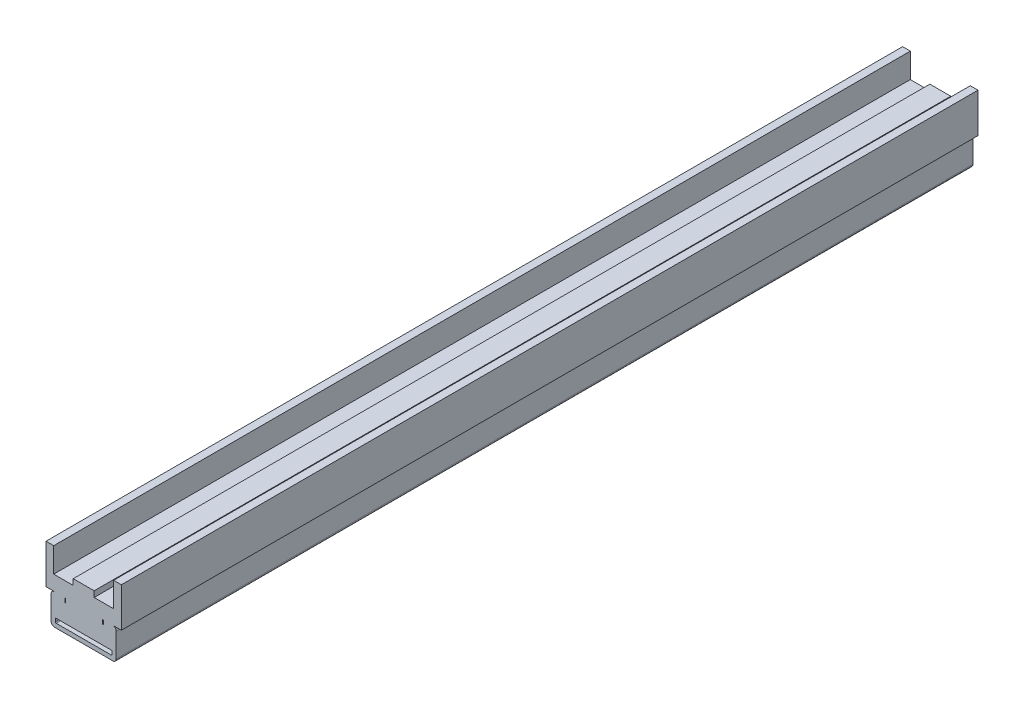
ISO-10303-21;
HEADER;
FILE_DESCRIPTION(('STEP AP214'),'2;1');
FILE_NAME('part.step','',(''),(''),'','','');
FILE_SCHEMA(('AUTOMOTIVE_DESIGN { 1 0 10303 214 1 1 1 1 }'));
ENDSEC;
DATA;
#1=APPLICATION_CONTEXT('core data for automotive mechanical design processes');
#2=APPLICATION_PROTOCOL_DEFINITION('international standard','automotive_design',2000,#1);
#3=PRODUCT_CONTEXT('',#1,'mechanical');
#4=PRODUCT('Part','Part','',(#3));
#5=PRODUCT_RELATED_PRODUCT_CATEGORY('part','',(#4));
#6=PRODUCT_DEFINITION_FORMATION('','',#4);
#7=PRODUCT_DEFINITION_CONTEXT('part definition',#1,'design');
#8=PRODUCT_DEFINITION('design','',#6,#7);
#9=PRODUCT_DEFINITION_SHAPE('','',#8);
#10=(LENGTH_UNIT() NAMED_UNIT(*) SI_UNIT(.MILLI.,.METRE.));
#11=(NAMED_UNIT(*) PLANE_ANGLE_UNIT() SI_UNIT($,.RADIAN.));
#12=(NAMED_UNIT(*) SI_UNIT($,.STERADIAN.) SOLID_ANGLE_UNIT());
#13=UNCERTAINTY_MEASURE_WITH_UNIT(LENGTH_MEASURE(1.E-05),#10,'distance_accuracy_value','');
#14=(GEOMETRIC_REPRESENTATION_CONTEXT(3) GLOBAL_UNCERTAINTY_ASSIGNED_CONTEXT((#13)) GLOBAL_UNIT_ASSIGNED_CONTEXT((#10,
#11,#12)) REPRESENTATION_CONTEXT('',''));
#15=CARTESIAN_POINT('',(0.,0.,0.));
#16=DIRECTION('',(0.,0.,1.));
#17=DIRECTION('',(1.,0.,0.));
#18=AXIS2_PLACEMENT_3D('',#15,#16,#17);
#19=CARTESIAN_POINT('',(17.,16.,500.));
#20=DIRECTION('',(0.,0.,1.));
#21=DIRECTION('',(1.,0.,0.));
#22=AXIS2_PLACEMENT_3D('',#19,#20,#21);
#23=PLANE('',#22);
#24=DIRECTION('',(1.,0.,0.));
#25=VECTOR('',#24,1.);
#26=CARTESIAN_POINT('',(-11.,15.5,500.));
#27=LINE('',#26,#25);
#28=CARTESIAN_POINT('',(-11.,15.5,500.));
#29=VERTEX_POINT('',#28);
#30=CARTESIAN_POINT('',(-10.5,15.5,500.));
#31=VERTEX_POINT('',#30);
#32=EDGE_CURVE('E273',#29,#31,#27,.T.);
#33=ORIENTED_EDGE('',*,*,#32,.F.);
#34=DIRECTION('',(0.,-1.,0.));
#35=VECTOR('',#34,1.);
#36=CARTESIAN_POINT('',(-11.,18.,500.));
#37=LINE('',#36,#35);
#38=CARTESIAN_POINT('',(-11.,18.,500.));
#39=VERTEX_POINT('',#38);
#40=EDGE_CURVE('E271',#39,#29,#37,.T.);
#41=ORIENTED_EDGE('',*,*,#40,.F.);
#42=DIRECTION('',(-1.,0.,0.));
#43=VECTOR('',#42,1.);
#44=CARTESIAN_POINT('',(-11.,18.,500.));
#45=LINE('',#44,#43);
#46=CARTESIAN_POINT('',(-10.5,18.,500.));
#47=VERTEX_POINT('',#46);
#48=EDGE_CURVE('E279',#47,#39,#45,.T.);
#49=ORIENTED_EDGE('',*,*,#48,.F.);
#50=DIRECTION('',(0.,1.,0.));
#51=VECTOR('',#50,1.);
#52=CARTESIAN_POINT('',(-10.5,18.,500.));
#53=LINE('',#52,#51);
#54=EDGE_CURVE('E276',#31,#47,#53,.T.);
#55=ORIENTED_EDGE('',*,*,#54,.F.);
#56=EDGE_LOOP('',(#33,#41,#49,#55));
#57=FACE_BOUND('',#56,.T.);
#58=DIRECTION('',(0.,-1.,0.));
#59=VECTOR('',#58,1.);
#60=CARTESIAN_POINT('',(-22.,18.,500.));
#61=LINE('',#60,#59);
#62=CARTESIAN_POINT('',(-22.,41.,500.));
#63=VERTEX_POINT('',#62);
#64=CARTESIAN_POINT('',(-22.,18.,500.));
#65=VERTEX_POINT('',#64);
#66=EDGE_CURVE('E347',#63,#65,#61,.T.);
#67=ORIENTED_EDGE('',*,*,#66,.T.);
#68=DIRECTION('',(1.,0.,0.));
#69=VECTOR('',#68,1.);
#70=CARTESIAN_POINT('',(-22.,18.,500.));
#71=LINE('',#70,#69);
#72=CARTESIAN_POINT('',(-17.,18.,500.));
#73=VERTEX_POINT('',#72);
#74=EDGE_CURVE('E350',#65,#73,#71,.T.);
#75=ORIENTED_EDGE('',*,*,#74,.T.);
#76=CARTESIAN_POINT('',(-17.,16.,500.));
#77=DIRECTION('',(0.,0.,1.));
#78=DIRECTION('',(1.,0.,0.));
#79=AXIS2_PLACEMENT_3D('',#76,#77,#78);
#80=CIRCLE('',#79,2.);
#81=CARTESIAN_POINT('',(-19.,16.,500.));
#82=VERTEX_POINT('',#81);
#83=EDGE_CURVE('E353',#73,#82,#80,.T.);
#84=ORIENTED_EDGE('',*,*,#83,.T.);
#85=DIRECTION('',(0.,-1.,0.));
#86=VECTOR('',#85,1.);
#87=CARTESIAN_POINT('',(-19.,2.,500.));
#88=LINE('',#87,#86);
#89=CARTESIAN_POINT('',(-19.,2.,500.));
#90=VERTEX_POINT('',#89);
#91=EDGE_CURVE('E355',#82,#90,#88,.T.);
#92=ORIENTED_EDGE('',*,*,#91,.T.);
#93=CARTESIAN_POINT('',(-17.,2.,500.));
#94=DIRECTION('',(0.,0.,1.));
#95=DIRECTION('',(1.,0.,0.));
#96=AXIS2_PLACEMENT_3D('',#93,#94,#95);
#97=CIRCLE('',#96,2.);
#98=CARTESIAN_POINT('',(-17.,0.,500.));
#99=VERTEX_POINT('',#98);
#100=EDGE_CURVE('E357',#90,#99,#97,.T.);
#101=ORIENTED_EDGE('',*,*,#100,.T.);
#102=DIRECTION('',(1.,0.,0.));
#103=VECTOR('',#102,1.);
#104=CARTESIAN_POINT('',(-17.,0.,500.));
#105=LINE('',#104,#103);
#106=CARTESIAN_POINT('',(17.,0.,500.));
#107=VERTEX_POINT('',#106);
#108=EDGE_CURVE('E359',#99,#107,#105,.T.);
#109=ORIENTED_EDGE('',*,*,#108,.T.);
#110=CARTESIAN_POINT('',(17.,2.,500.));
#111=DIRECTION('',(0.,0.,1.));
#112=DIRECTION('',(-1.,0.,0.));
#113=AXIS2_PLACEMENT_3D('',#110,#111,#112);
#114=CIRCLE('',#113,2.);
#115=CARTESIAN_POINT('',(19.,2.,500.));
#116=VERTEX_POINT('',#115);
#117=EDGE_CURVE('E361',#107,#116,#114,.T.);
#118=ORIENTED_EDGE('',*,*,#117,.T.);
#119=DIRECTION('',(0.,1.,0.));
#120=VECTOR('',#119,1.);
#121=CARTESIAN_POINT('',(19.,2.,500.));
#122=LINE('',#121,#120);
#123=CARTESIAN_POINT('',(19.,16.,500.));
#124=VERTEX_POINT('',#123);
#125=EDGE_CURVE('E363',#116,#124,#122,.T.);
#126=ORIENTED_EDGE('',*,*,#125,.T.);
#127=CARTESIAN_POINT('',(17.,16.,500.));
#128=DIRECTION('',(0.,0.,1.));
#129=DIRECTION('',(1.,0.,0.));
#130=AXIS2_PLACEMENT_3D('',#127,#128,#129);
#131=CIRCLE('',#130,2.);
#132=CARTESIAN_POINT('',(17.,18.,500.));
#133=VERTEX_POINT('',#132);
#134=EDGE_CURVE('E365',#124,#133,#131,.T.);
#135=ORIENTED_EDGE('',*,*,#134,.T.);
#136=DIRECTION('',(1.,0.,0.));
#137=VECTOR('',#136,1.);
#138=CARTESIAN_POINT('',(17.,18.,500.));
#139=LINE('',#138,#137);
#140=CARTESIAN_POINT('',(22.,18.,500.));
#141=VERTEX_POINT('',#140);
#142=EDGE_CURVE('E367',#133,#141,#139,.T.);
#143=ORIENTED_EDGE('',*,*,#142,.T.);
#144=DIRECTION('',(0.,1.,0.));
#145=VECTOR('',#144,1.);
#146=CARTESIAN_POINT('',(22.,18.,500.));
#147=LINE('',#146,#145);
#148=CARTESIAN_POINT('',(22.,41.,500.));
#149=VERTEX_POINT('',#148);
#150=EDGE_CURVE('E369',#141,#149,#147,.T.);
#151=ORIENTED_EDGE('',*,*,#150,.T.);
#152=DIRECTION('',(-1.,0.,0.));
#153=VECTOR('',#152,1.);
#154=CARTESIAN_POINT('',(17.5,41.,500.));
#155=LINE('',#154,#153);
#156=CARTESIAN_POINT('',(17.5,41.,500.));
#157=VERTEX_POINT('',#156);
#158=EDGE_CURVE('E371',#149,#157,#155,.T.);
#159=ORIENTED_EDGE('',*,*,#158,.T.);
#160=DIRECTION('',(0.,-1.,0.));
#161=VECTOR('',#160,1.);
#162=CARTESIAN_POINT('',(17.5,26.6,500.));
#163=LINE('',#162,#161);
#164=CARTESIAN_POINT('',(17.5,26.6,500.));
#165=VERTEX_POINT('',#164);
#166=EDGE_CURVE('E373',#157,#165,#163,.T.);
#167=ORIENTED_EDGE('',*,*,#166,.T.);
#168=DIRECTION('',(-1.,0.,0.));
#169=VECTOR('',#168,1.);
#170=CARTESIAN_POINT('',(6.1,26.6,500.));
#171=LINE('',#170,#169);
#172=CARTESIAN_POINT('',(6.1,26.6,500.));
#173=VERTEX_POINT('',#172);
#174=EDGE_CURVE('E375',#165,#173,#171,.T.);
#175=ORIENTED_EDGE('',*,*,#174,.T.);
#176=DIRECTION('',(0.,1.,0.));
#177=VECTOR('',#176,1.);
#178=CARTESIAN_POINT('',(6.1,30.,500.));
#179=LINE('',#178,#177);
#180=CARTESIAN_POINT('',(6.1,30.,500.));
#181=VERTEX_POINT('',#180);
#182=EDGE_CURVE('E377',#173,#181,#179,.T.);
#183=ORIENTED_EDGE('',*,*,#182,.T.);
#184=DIRECTION('',(-1.,0.,0.));
#185=VECTOR('',#184,1.);
#186=CARTESIAN_POINT('',(-6.1,30.,500.));
#187=LINE('',#186,#185);
#188=CARTESIAN_POINT('',(-6.1,30.,500.));
#189=VERTEX_POINT('',#188);
#190=EDGE_CURVE('E379',#181,#189,#187,.T.);
#191=ORIENTED_EDGE('',*,*,#190,.T.);
#192=DIRECTION('',(0.,-1.,0.));
#193=VECTOR('',#192,1.);
#194=CARTESIAN_POINT('',(-6.1,26.6,500.));
#195=LINE('',#194,#193);
#196=CARTESIAN_POINT('',(-6.1,26.6,500.));
#197=VERTEX_POINT('',#196);
#198=EDGE_CURVE('E381',#189,#197,#195,.T.);
#199=ORIENTED_EDGE('',*,*,#198,.T.);
#200=DIRECTION('',(-1.,0.,0.));
#201=VECTOR('',#200,1.);
#202=CARTESIAN_POINT('',(-17.5,26.6,500.));
#203=LINE('',#202,#201);
#204=CARTESIAN_POINT('',(-17.5,26.6,500.));
#205=VERTEX_POINT('',#204);
#206=EDGE_CURVE('E383',#197,#205,#203,.T.);
#207=ORIENTED_EDGE('',*,*,#206,.T.);
#208=DIRECTION('',(0.,1.,0.));
#209=VECTOR('',#208,1.);
#210=CARTESIAN_POINT('',(-17.5,41.,500.));
#211=LINE('',#210,#209);
#212=CARTESIAN_POINT('',(-17.5,41.,500.));
#213=VERTEX_POINT('',#212);
#214=EDGE_CURVE('E385',#205,#213,#211,.T.);
#215=ORIENTED_EDGE('',*,*,#214,.T.);
#216=DIRECTION('',(-1.,0.,0.));
#217=VECTOR('',#216,1.);
#218=CARTESIAN_POINT('',(-22.,41.,500.));
#219=LINE('',#218,#217);
#220=EDGE_CURVE('E387',#213,#63,#219,.T.);
#221=ORIENTED_EDGE('',*,*,#220,.T.);
#222=EDGE_LOOP('',(#67,#75,#84,#92,#101,#109,#118,#126,#135,#143,#151,#159,#167,#175,#183,#191,
#199,#207,#215,#221));
#223=FACE_BOUND('',#222,.T.);
#224=CARTESIAN_POINT('',(-16.,3.,500.));
#225=DIRECTION('',(0.,0.,1.));
#226=DIRECTION('',(-1.,0.,0.));
#227=AXIS2_PLACEMENT_3D('',#224,#225,#226);
#228=CIRCLE('',#227,0.5);
#229=CARTESIAN_POINT('',(-16.5,3.,500.));
#230=VERTEX_POINT('',#229);
#231=CARTESIAN_POINT('',(-16.,2.5,500.));
#232=VERTEX_POINT('',#231);
#233=EDGE_CURVE('E304',#230,#232,#228,.T.);
#234=ORIENTED_EDGE('',*,*,#233,.F.);
#235=DIRECTION('',(0.,-1.,0.));
#236=VECTOR('',#235,1.);
#237=CARTESIAN_POINT('',(-16.5,5.,500.));
#238=LINE('',#237,#236);
#239=CARTESIAN_POINT('',(-16.5,5.,500.));
#240=VERTEX_POINT('',#239);
#241=EDGE_CURVE('E302',#240,#230,#238,.T.);
#242=ORIENTED_EDGE('',*,*,#241,.F.);
#243=DIRECTION('',(-1.,0.,0.));
#244=VECTOR('',#243,1.);
#245=CARTESIAN_POINT('',(-16.5,5.,500.));
#246=LINE('',#245,#244);
#247=CARTESIAN_POINT('',(16.5,5.,500.));
#248=VERTEX_POINT('',#247);
#249=EDGE_CURVE('E314',#248,#240,#246,.T.);
#250=ORIENTED_EDGE('',*,*,#249,.F.);
#251=DIRECTION('',(0.,1.,0.));
#252=VECTOR('',#251,1.);
#253=CARTESIAN_POINT('',(16.5,5.,500.));
#254=LINE('',#253,#252);
#255=CARTESIAN_POINT('',(16.5,3.,500.));
#256=VERTEX_POINT('',#255);
#257=EDGE_CURVE('E311',#256,#248,#254,.T.);
#258=ORIENTED_EDGE('',*,*,#257,.F.);
#259=CARTESIAN_POINT('',(16.,3.,500.));
#260=DIRECTION('',(0.,0.,1.));
#261=DIRECTION('',(-1.,0.,0.));
#262=AXIS2_PLACEMENT_3D('',#259,#260,#261);
#263=CIRCLE('',#262,0.5);
#264=CARTESIAN_POINT('',(16.,2.5,500.));
#265=VERTEX_POINT('',#264);
#266=EDGE_CURVE('E309',#265,#256,#263,.T.);
#267=ORIENTED_EDGE('',*,*,#266,.F.);
#268=DIRECTION('',(1.,0.,0.));
#269=VECTOR('',#268,1.);
#270=CARTESIAN_POINT('',(-16.,2.5,500.));
#271=LINE('',#270,#269);
#272=EDGE_CURVE('E307',#232,#265,#271,.T.);
#273=ORIENTED_EDGE('',*,*,#272,.F.);
#274=EDGE_LOOP('',(#234,#242,#250,#258,#267,#273));
#275=FACE_BOUND('',#274,.T.);
#276=DIRECTION('',(1.,0.,0.));
#277=VECTOR('',#276,1.);
#278=CARTESIAN_POINT('',(11.,15.5,500.));
#279=LINE('',#278,#277);
#280=CARTESIAN_POINT('',(11.,15.5,500.));
#281=VERTEX_POINT('',#280);
#282=CARTESIAN_POINT('',(11.5,15.5,500.));
#283=VERTEX_POINT('',#282);
#284=EDGE_CURVE('E243',#281,#283,#279,.T.);
#285=ORIENTED_EDGE('',*,*,#284,.F.);
#286=DIRECTION('',(0.,-1.,0.));
#287=VECTOR('',#286,1.);
#288=CARTESIAN_POINT('',(11.,18.,500.));
#289=LINE('',#288,#287);
#290=CARTESIAN_POINT('',(11.,18.,500.));
#291=VERTEX_POINT('',#290);
#292=EDGE_CURVE('E235',#291,#281,#289,.T.);
#293=ORIENTED_EDGE('',*,*,#292,.F.);
#294=DIRECTION('',(-1.,0.,0.));
#295=VECTOR('',#294,1.);
#296=CARTESIAN_POINT('',(11.,18.,500.));
#297=LINE('',#296,#295);
#298=CARTESIAN_POINT('',(11.5,18.,500.));
#299=VERTEX_POINT('',#298);
#300=EDGE_CURVE('E257',#299,#291,#297,.T.);
#301=ORIENTED_EDGE('',*,*,#300,.F.);
#302=DIRECTION('',(0.,1.,0.));
#303=VECTOR('',#302,1.);
#304=CARTESIAN_POINT('',(11.5,18.,500.));
#305=LINE('',#304,#303);
#306=EDGE_CURVE('E255',#283,#299,#305,.T.);
#307=ORIENTED_EDGE('',*,*,#306,.F.);
#308=EDGE_LOOP('',(#285,#293,#301,#307));
#309=FACE_BOUND('',#308,.T.);
#310=ADVANCED_FACE('F14',(#57,#223,#275,#309),#23,.T.);
#311=CARTESIAN_POINT('',(17.,16.,0.));
#312=DIRECTION('',(0.,0.,1.));
#313=DIRECTION('',(1.,0.,0.));
#314=AXIS2_PLACEMENT_3D('',#311,#312,#313);
#315=PLANE('',#314);
#316=DIRECTION('',(0.,-1.,0.));
#317=VECTOR('',#316,1.);
#318=CARTESIAN_POINT('',(-11.,18.,0.));
#319=LINE('',#318,#317);
#320=CARTESIAN_POINT('',(-11.,18.,0.));
#321=VERTEX_POINT('',#320);
#322=CARTESIAN_POINT('',(-11.,15.5,0.));
#323=VERTEX_POINT('',#322);
#324=EDGE_CURVE('E251',#321,#323,#319,.T.);
#325=ORIENTED_EDGE('',*,*,#324,.T.);
#326=DIRECTION('',(1.,0.,0.));
#327=VECTOR('',#326,1.);
#328=CARTESIAN_POINT('',(-11.,15.5,0.));
#329=LINE('',#328,#327);
#330=CARTESIAN_POINT('',(-10.5,15.5,0.));
#331=VERTEX_POINT('',#330);
#332=EDGE_CURVE('E284',#323,#331,#329,.T.);
#333=ORIENTED_EDGE('',*,*,#332,.T.);
#334=DIRECTION('',(0.,1.,0.));
#335=VECTOR('',#334,1.);
#336=CARTESIAN_POINT('',(-10.5,18.,0.));
#337=LINE('',#336,#335);
#338=CARTESIAN_POINT('',(-10.5,18.,0.));
#339=VERTEX_POINT('',#338);
#340=EDGE_CURVE('E287',#331,#339,#337,.T.);
#341=ORIENTED_EDGE('',*,*,#340,.T.);
#342=DIRECTION('',(-1.,0.,0.));
#343=VECTOR('',#342,1.);
#344=CARTESIAN_POINT('',(-11.,18.,0.));
#345=LINE('',#344,#343);
#346=EDGE_CURVE('E274',#339,#321,#345,.T.);
#347=ORIENTED_EDGE('',*,*,#346,.T.);
#348=EDGE_LOOP('',(#325,#333,#341,#347));
#349=FACE_BOUND('',#348,.T.);
#350=DIRECTION('',(0.,-1.,0.));
#351=VECTOR('',#350,1.);
#352=CARTESIAN_POINT('',(-22.,18.,0.));
#353=LINE('',#352,#351);
#354=CARTESIAN_POINT('',(-22.,41.,0.));
#355=VERTEX_POINT('',#354);
#356=CARTESIAN_POINT('',(-22.,18.,0.));
#357=VERTEX_POINT('',#356);
#358=EDGE_CURVE('E346',#355,#357,#353,.T.);
#359=ORIENTED_EDGE('',*,*,#358,.F.);
#360=DIRECTION('',(-1.,0.,0.));
#361=VECTOR('',#360,1.);
#362=CARTESIAN_POINT('',(-22.,41.,0.));
#363=LINE('',#362,#361);
#364=CARTESIAN_POINT('',(-17.5,41.,0.));
#365=VERTEX_POINT('',#364);
#366=EDGE_CURVE('E351',#365,#355,#363,.T.);
#367=ORIENTED_EDGE('',*,*,#366,.F.);
#368=DIRECTION('',(0.,1.,0.));
#369=VECTOR('',#368,1.);
#370=CARTESIAN_POINT('',(-17.5,41.,0.));
#371=LINE('',#370,#369);
#372=CARTESIAN_POINT('',(-17.5,26.6,0.));
#373=VERTEX_POINT('',#372);
#374=EDGE_CURVE('E426',#373,#365,#371,.T.);
#375=ORIENTED_EDGE('',*,*,#374,.F.);
#376=DIRECTION('',(-1.,0.,0.));
#377=VECTOR('',#376,1.);
#378=CARTESIAN_POINT('',(-17.5,26.6,0.));
#379=LINE('',#378,#377);
#380=CARTESIAN_POINT('',(-6.1,26.6,0.));
#381=VERTEX_POINT('',#380);
#382=EDGE_CURVE('E424',#381,#373,#379,.T.);
#383=ORIENTED_EDGE('',*,*,#382,.F.);
#384=DIRECTION('',(0.,-1.,0.));
#385=VECTOR('',#384,1.);
#386=CARTESIAN_POINT('',(-6.1,26.6,0.));
#387=LINE('',#386,#385);
#388=CARTESIAN_POINT('',(-6.1,30.,0.));
#389=VERTEX_POINT('',#388);
#390=EDGE_CURVE('E422',#389,#381,#387,.T.);
#391=ORIENTED_EDGE('',*,*,#390,.F.);
#392=DIRECTION('',(-1.,0.,0.));
#393=VECTOR('',#392,1.);
#394=CARTESIAN_POINT('',(-6.1,30.,0.));
#395=LINE('',#394,#393);
#396=CARTESIAN_POINT('',(6.1,30.,0.));
#397=VERTEX_POINT('',#396);
#398=EDGE_CURVE('E420',#397,#389,#395,.T.);
#399=ORIENTED_EDGE('',*,*,#398,.F.);
#400=DIRECTION('',(0.,1.,0.));
#401=VECTOR('',#400,1.);
#402=CARTESIAN_POINT('',(6.1,30.,0.));
#403=LINE('',#402,#401);
#404=CARTESIAN_POINT('',(6.1,26.6,0.));
#405=VERTEX_POINT('',#404);
#406=EDGE_CURVE('E418',#405,#397,#403,.T.);
#407=ORIENTED_EDGE('',*,*,#406,.F.);
#408=DIRECTION('',(-1.,0.,0.));
#409=VECTOR('',#408,1.);
#410=CARTESIAN_POINT('',(6.1,26.6,0.));
#411=LINE('',#410,#409);
#412=CARTESIAN_POINT('',(17.5,26.6,0.));
#413=VERTEX_POINT('',#412);
#414=EDGE_CURVE('E416',#413,#405,#411,.T.);
#415=ORIENTED_EDGE('',*,*,#414,.F.);
#416=DIRECTION('',(0.,-1.,0.));
#417=VECTOR('',#416,1.);
#418=CARTESIAN_POINT('',(17.5,26.6,0.));
#419=LINE('',#418,#417);
#420=CARTESIAN_POINT('',(17.5,41.,0.));
#421=VERTEX_POINT('',#420);
#422=EDGE_CURVE('E414',#421,#413,#419,.T.);
#423=ORIENTED_EDGE('',*,*,#422,.F.);
#424=DIRECTION('',(-1.,0.,0.));
#425=VECTOR('',#424,1.);
#426=CARTESIAN_POINT('',(17.5,41.,0.));
#427=LINE('',#426,#425);
#428=CARTESIAN_POINT('',(22.,41.,0.));
#429=VERTEX_POINT('',#428);
#430=EDGE_CURVE('E412',#429,#421,#427,.T.);
#431=ORIENTED_EDGE('',*,*,#430,.F.);
#432=DIRECTION('',(0.,1.,0.));
#433=VECTOR('',#432,1.);
#434=CARTESIAN_POINT('',(22.,18.,0.));
#435=LINE('',#434,#433);
#436=CARTESIAN_POINT('',(22.,18.,0.));
#437=VERTEX_POINT('',#436);
#438=EDGE_CURVE('E410',#437,#429,#435,.T.);
#439=ORIENTED_EDGE('',*,*,#438,.F.);
#440=DIRECTION('',(1.,0.,0.));
#441=VECTOR('',#440,1.);
#442=CARTESIAN_POINT('',(17.,18.,0.));
#443=LINE('',#442,#441);
#444=CARTESIAN_POINT('',(17.,18.,0.));
#445=VERTEX_POINT('',#444);
#446=EDGE_CURVE('E408',#445,#437,#443,.T.);
#447=ORIENTED_EDGE('',*,*,#446,.F.);
#448=CARTESIAN_POINT('',(17.,16.,0.));
#449=DIRECTION('',(0.,0.,1.));
#450=DIRECTION('',(1.,0.,0.));
#451=AXIS2_PLACEMENT_3D('',#448,#449,#450);
#452=CIRCLE('',#451,2.);
#453=CARTESIAN_POINT('',(19.,16.,0.));
#454=VERTEX_POINT('',#453);
#455=EDGE_CURVE('E406',#454,#445,#452,.T.);
#456=ORIENTED_EDGE('',*,*,#455,.F.);
#457=DIRECTION('',(0.,1.,0.));
#458=VECTOR('',#457,1.);
#459=CARTESIAN_POINT('',(19.,2.,0.));
#460=LINE('',#459,#458);
#461=CARTESIAN_POINT('',(19.,2.,0.));
#462=VERTEX_POINT('',#461);
#463=EDGE_CURVE('E404',#462,#454,#460,.T.);
#464=ORIENTED_EDGE('',*,*,#463,.F.);
#465=CARTESIAN_POINT('',(17.,2.,0.));
#466=DIRECTION('',(0.,0.,1.));
#467=DIRECTION('',(-1.,0.,0.));
#468=AXIS2_PLACEMENT_3D('',#465,#466,#467);
#469=CIRCLE('',#468,2.);
#470=CARTESIAN_POINT('',(17.,0.,0.));
#471=VERTEX_POINT('',#470);
#472=EDGE_CURVE('E402',#471,#462,#469,.T.);
#473=ORIENTED_EDGE('',*,*,#472,.F.);
#474=DIRECTION('',(1.,0.,0.));
#475=VECTOR('',#474,1.);
#476=CARTESIAN_POINT('',(-17.,0.,0.));
#477=LINE('',#476,#475);
#478=CARTESIAN_POINT('',(-17.,0.,0.));
#479=VERTEX_POINT('',#478);
#480=EDGE_CURVE('E400',#479,#471,#477,.T.);
#481=ORIENTED_EDGE('',*,*,#480,.F.);
#482=CARTESIAN_POINT('',(-17.,2.,0.));
#483=DIRECTION('',(0.,0.,1.));
#484=DIRECTION('',(1.,0.,0.));
#485=AXIS2_PLACEMENT_3D('',#482,#483,#484);
#486=CIRCLE('',#485,2.);
#487=CARTESIAN_POINT('',(-19.,2.,0.));
#488=VERTEX_POINT('',#487);
#489=EDGE_CURVE('E398',#488,#479,#486,.T.);
#490=ORIENTED_EDGE('',*,*,#489,.F.);
#491=DIRECTION('',(0.,-1.,0.));
#492=VECTOR('',#491,1.);
#493=CARTESIAN_POINT('',(-19.,2.,0.));
#494=LINE('',#493,#492);
#495=CARTESIAN_POINT('',(-19.,16.,0.));
#496=VERTEX_POINT('',#495);
#497=EDGE_CURVE('E396',#496,#488,#494,.T.);
#498=ORIENTED_EDGE('',*,*,#497,.F.);
#499=CARTESIAN_POINT('',(-17.,16.,0.));
#500=DIRECTION('',(0.,0.,1.));
#501=DIRECTION('',(1.,0.,0.));
#502=AXIS2_PLACEMENT_3D('',#499,#500,#501);
#503=CIRCLE('',#502,2.);
#504=CARTESIAN_POINT('',(-17.,18.,0.));
#505=VERTEX_POINT('',#504);
#506=EDGE_CURVE('E394',#505,#496,#503,.T.);
#507=ORIENTED_EDGE('',*,*,#506,.F.);
#508=DIRECTION('',(1.,0.,0.));
#509=VECTOR('',#508,1.);
#510=CARTESIAN_POINT('',(-22.,18.,0.));
#511=LINE('',#510,#509);
#512=EDGE_CURVE('E392',#357,#505,#511,.T.);
#513=ORIENTED_EDGE('',*,*,#512,.F.);
#514=EDGE_LOOP('',(#359,#367,#375,#383,#391,#399,#407,#415,#423,#431,#439,#447,#456,#464,#473,
#481,#490,#498,#507,#513));
#515=FACE_BOUND('',#514,.T.);
#516=DIRECTION('',(0.,-1.,0.));
#517=VECTOR('',#516,1.);
#518=CARTESIAN_POINT('',(-16.5,5.,0.));
#519=LINE('',#518,#517);
#520=CARTESIAN_POINT('',(-16.5,5.,0.));
#521=VERTEX_POINT('',#520);
#522=CARTESIAN_POINT('',(-16.5,3.,0.));
#523=VERTEX_POINT('',#522);
#524=EDGE_CURVE('E301',#521,#523,#519,.T.);
#525=ORIENTED_EDGE('',*,*,#524,.T.);
#526=CARTESIAN_POINT('',(-16.,3.,0.));
#527=DIRECTION('',(0.,0.,1.));
#528=DIRECTION('',(-1.,0.,0.));
#529=AXIS2_PLACEMENT_3D('',#526,#527,#528);
#530=CIRCLE('',#529,0.5);
#531=CARTESIAN_POINT('',(-16.,2.5,0.));
#532=VERTEX_POINT('',#531);
#533=EDGE_CURVE('E319',#523,#532,#530,.T.);
#534=ORIENTED_EDGE('',*,*,#533,.T.);
#535=DIRECTION('',(1.,0.,0.));
#536=VECTOR('',#535,1.);
#537=CARTESIAN_POINT('',(-16.,2.5,0.));
#538=LINE('',#537,#536);
#539=CARTESIAN_POINT('',(16.,2.5,0.));
#540=VERTEX_POINT('',#539);
#541=EDGE_CURVE('E322',#532,#540,#538,.T.);
#542=ORIENTED_EDGE('',*,*,#541,.T.);
#543=CARTESIAN_POINT('',(16.,3.,0.));
#544=DIRECTION('',(0.,0.,1.));
#545=DIRECTION('',(-1.,0.,0.));
#546=AXIS2_PLACEMENT_3D('',#543,#544,#545);
#547=CIRCLE('',#546,0.5);
#548=CARTESIAN_POINT('',(16.5,3.,0.));
#549=VERTEX_POINT('',#548);
#550=EDGE_CURVE('E325',#540,#549,#547,.T.);
#551=ORIENTED_EDGE('',*,*,#550,.T.);
#552=DIRECTION('',(0.,1.,0.));
#553=VECTOR('',#552,1.);
#554=CARTESIAN_POINT('',(16.5,5.,0.));
#555=LINE('',#554,#553);
#556=CARTESIAN_POINT('',(16.5,5.,0.));
#557=VERTEX_POINT('',#556);
#558=EDGE_CURVE('E328',#549,#557,#555,.T.);
#559=ORIENTED_EDGE('',*,*,#558,.T.);
#560=DIRECTION('',(-1.,0.,0.));
#561=VECTOR('',#560,1.);
#562=CARTESIAN_POINT('',(-16.5,5.,0.));
#563=LINE('',#562,#561);
#564=EDGE_CURVE('E305',#557,#521,#563,.T.);
#565=ORIENTED_EDGE('',*,*,#564,.T.);
#566=EDGE_LOOP('',(#525,#534,#542,#551,#559,#565));
#567=FACE_BOUND('',#566,.T.);
#568=DIRECTION('',(0.,-1.,0.));
#569=VECTOR('',#568,1.);
#570=CARTESIAN_POINT('',(11.,18.,0.));
#571=LINE('',#570,#569);
#572=CARTESIAN_POINT('',(11.,18.,0.));
#573=VERTEX_POINT('',#572);
#574=CARTESIAN_POINT('',(11.,15.5,0.));
#575=VERTEX_POINT('',#574);
#576=EDGE_CURVE('E37',#573,#575,#571,.T.);
#577=ORIENTED_EDGE('',*,*,#576,.T.);
#578=DIRECTION('',(1.,0.,0.));
#579=VECTOR('',#578,1.);
#580=CARTESIAN_POINT('',(11.,15.5,0.));
#581=LINE('',#580,#579);
#582=CARTESIAN_POINT('',(11.5,15.5,0.));
#583=VERTEX_POINT('',#582);
#584=EDGE_CURVE('E250',#575,#583,#581,.T.);
#585=ORIENTED_EDGE('',*,*,#584,.T.);
#586=DIRECTION('',(0.,1.,0.));
#587=VECTOR('',#586,1.);
#588=CARTESIAN_POINT('',(11.5,18.,0.));
#589=LINE('',#588,#587);
#590=CARTESIAN_POINT('',(11.5,18.,0.));
#591=VERTEX_POINT('',#590);
#592=EDGE_CURVE('E263',#583,#591,#589,.T.);
#593=ORIENTED_EDGE('',*,*,#592,.T.);
#594=DIRECTION('',(-1.,0.,0.));
#595=VECTOR('',#594,1.);
#596=CARTESIAN_POINT('',(11.,18.,0.));
#597=LINE('',#596,#595);
#598=EDGE_CURVE('E244',#591,#573,#597,.T.);
#599=ORIENTED_EDGE('',*,*,#598,.T.);
#600=EDGE_LOOP('',(#577,#585,#593,#599));
#601=FACE_BOUND('',#600,.T.);
#602=ADVANCED_FACE('F492',(#349,#515,#567,#601),#315,.F.);
#603=CARTESIAN_POINT('',(-22.,18.,500.));
#604=DIRECTION('',(1.,0.,0.));
#605=DIRECTION('',(0.,0.,-1.));
#606=AXIS2_PLACEMENT_3D('',#603,#604,#605);
#607=PLANE('',#606);
#608=ORIENTED_EDGE('',*,*,#358,.T.);
#609=DIRECTION('',(0.,0.,-1.));
#610=VECTOR('',#609,1.);
#611=CARTESIAN_POINT('',(-22.,18.,500.));
#612=LINE('',#611,#610);
#613=EDGE_CURVE('E9',#65,#357,#612,.T.);
#614=ORIENTED_EDGE('',*,*,#613,.F.);
#615=ORIENTED_EDGE('',*,*,#66,.F.);
#616=DIRECTION('',(0.,0.,-1.));
#617=VECTOR('',#616,1.);
#618=CARTESIAN_POINT('',(-22.,41.,500.));
#619=LINE('',#618,#617);
#620=EDGE_CURVE('E389',#63,#355,#619,.T.);
#621=ORIENTED_EDGE('',*,*,#620,.T.);
#622=EDGE_LOOP('',(#608,#614,#615,#621));
#623=FACE_BOUND('',#622,.T.);
#624=ADVANCED_FACE('F16',(#623),#607,.F.);
#625=CARTESIAN_POINT('',(-22.,18.,500.));
#626=DIRECTION('',(0.,1.,0.));
#627=DIRECTION('',(0.,0.,1.));
#628=AXIS2_PLACEMENT_3D('',#625,#626,#627);
#629=PLANE('',#628);
#630=ORIENTED_EDGE('',*,*,#512,.T.);
#631=DIRECTION('',(0.,0.,-1.));
#632=VECTOR('',#631,1.);
#633=CARTESIAN_POINT('',(-17.,18.,500.));
#634=LINE('',#633,#632);
#635=EDGE_CURVE('E22',#73,#505,#634,.T.);
#636=ORIENTED_EDGE('',*,*,#635,.F.);
#637=ORIENTED_EDGE('',*,*,#74,.F.);
#638=ORIENTED_EDGE('',*,*,#613,.T.);
#639=EDGE_LOOP('',(#630,#636,#637,#638));
#640=FACE_BOUND('',#639,.T.);
#641=ADVANCED_FACE('F510',(#640),#629,.F.);
#642=CARTESIAN_POINT('',(-17.,16.,500.));
#643=DIRECTION('',(0.,0.,-1.));
#644=DIRECTION('',(-1.,0.,0.));
#645=AXIS2_PLACEMENT_3D('',#642,#643,#644);
#646=CYLINDRICAL_SURFACE('',#645,2.);
#647=ORIENTED_EDGE('',*,*,#506,.T.);
#648=DIRECTION('',(0.,0.,-1.));
#649=VECTOR('',#648,1.);
#650=CARTESIAN_POINT('',(-19.,16.,500.));
#651=LINE('',#650,#649);
#652=EDGE_CURVE('E479',#82,#496,#651,.T.);
#653=ORIENTED_EDGE('',*,*,#652,.F.);
#654=ORIENTED_EDGE('',*,*,#83,.F.);
#655=ORIENTED_EDGE('',*,*,#635,.T.);
#656=EDGE_LOOP('',(#647,#653,#654,#655));
#657=FACE_BOUND('',#656,.T.);
#658=ADVANCED_FACE('F486',(#657),#646,.T.);
#659=CARTESIAN_POINT('',(-19.,2.,500.));
#660=DIRECTION('',(1.,0.,0.));
#661=DIRECTION('',(0.,0.,-1.));
#662=AXIS2_PLACEMENT_3D('',#659,#660,#661);
#663=PLANE('',#662);
#664=ORIENTED_EDGE('',*,*,#497,.T.);
#665=DIRECTION('',(0.,0.,-1.));
#666=VECTOR('',#665,1.);
#667=CARTESIAN_POINT('',(-19.,2.,500.));
#668=LINE('',#667,#666);
#669=EDGE_CURVE('E476',#90,#488,#668,.T.);
#670=ORIENTED_EDGE('',*,*,#669,.F.);
#671=ORIENTED_EDGE('',*,*,#91,.F.);
#672=ORIENTED_EDGE('',*,*,#652,.T.);
#673=EDGE_LOOP('',(#664,#670,#671,#672));
#674=FACE_BOUND('',#673,.T.);
#675=ADVANCED_FACE('F498',(#674),#663,.F.);
#676=CARTESIAN_POINT('',(-17.,2.,500.));
#677=DIRECTION('',(0.,0.,-1.));
#678=DIRECTION('',(-1.,0.,0.));
#679=AXIS2_PLACEMENT_3D('',#676,#677,#678);
#680=CYLINDRICAL_SURFACE('',#679,2.);
#681=ORIENTED_EDGE('',*,*,#489,.T.);
#682=DIRECTION('',(0.,0.,-1.));
#683=VECTOR('',#682,1.);
#684=CARTESIAN_POINT('',(-17.,0.,500.));
#685=LINE('',#684,#683);
#686=EDGE_CURVE('E473',#99,#479,#685,.T.);
#687=ORIENTED_EDGE('',*,*,#686,.F.);
#688=ORIENTED_EDGE('',*,*,#100,.F.);
#689=ORIENTED_EDGE('',*,*,#669,.T.);
#690=EDGE_LOOP('',(#681,#687,#688,#689));
#691=FACE_BOUND('',#690,.T.);
#692=ADVANCED_FACE('F502',(#691),#680,.T.);
#693=CARTESIAN_POINT('',(-17.,0.,500.));
#694=DIRECTION('',(0.,1.,0.));
#695=DIRECTION('',(0.,0.,1.));
#696=AXIS2_PLACEMENT_3D('',#693,#694,#695);
#697=PLANE('',#696);
#698=ORIENTED_EDGE('',*,*,#480,.T.);
#699=DIRECTION('',(0.,0.,-1.));
#700=VECTOR('',#699,1.);
#701=CARTESIAN_POINT('',(17.,0.,500.));
#702=LINE('',#701,#700);
#703=EDGE_CURVE('E470',#107,#471,#702,.T.);
#704=ORIENTED_EDGE('',*,*,#703,.F.);
#705=ORIENTED_EDGE('',*,*,#108,.F.);
#706=ORIENTED_EDGE('',*,*,#686,.T.);
#707=EDGE_LOOP('',(#698,#704,#705,#706));
#708=FACE_BOUND('',#707,.T.);
#709=ADVANCED_FACE('F583',(#708),#697,.F.);
#710=CARTESIAN_POINT('',(17.,2.,500.));
#711=DIRECTION('',(0.,0.,-1.));
#712=DIRECTION('',(-1.,0.,0.));
#713=AXIS2_PLACEMENT_3D('',#710,#711,#712);
#714=CYLINDRICAL_SURFACE('',#713,2.);
#715=ORIENTED_EDGE('',*,*,#472,.T.);
#716=DIRECTION('',(0.,0.,-1.));
#717=VECTOR('',#716,1.);
#718=CARTESIAN_POINT('',(19.,2.,500.));
#719=LINE('',#718,#717);
#720=EDGE_CURVE('E467',#116,#462,#719,.T.);
#721=ORIENTED_EDGE('',*,*,#720,.F.);
#722=ORIENTED_EDGE('',*,*,#117,.F.);
#723=ORIENTED_EDGE('',*,*,#703,.T.);
#724=EDGE_LOOP('',(#715,#721,#722,#723));
#725=FACE_BOUND('',#724,.T.);
#726=ADVANCED_FACE('F581',(#725),#714,.T.);
#727=CARTESIAN_POINT('',(19.,2.,500.));
#728=DIRECTION('',(-1.,0.,0.));
#729=DIRECTION('',(0.,0.,1.));
#730=AXIS2_PLACEMENT_3D('',#727,#728,#729);
#731=PLANE('',#730);
#732=ORIENTED_EDGE('',*,*,#463,.T.);
#733=DIRECTION('',(0.,0.,-1.));
#734=VECTOR('',#733,1.);
#735=CARTESIAN_POINT('',(19.,16.,500.));
#736=LINE('',#735,#734);
#737=EDGE_CURVE('E464',#124,#454,#736,.T.);
#738=ORIENTED_EDGE('',*,*,#737,.F.);
#739=ORIENTED_EDGE('',*,*,#125,.F.);
#740=ORIENTED_EDGE('',*,*,#720,.T.);
#741=EDGE_LOOP('',(#732,#738,#739,#740));
#742=FACE_BOUND('',#741,.T.);
#743=ADVANCED_FACE('F576',(#742),#731,.F.);
#744=CARTESIAN_POINT('',(17.,16.,500.));
#745=DIRECTION('',(0.,0.,-1.));
#746=DIRECTION('',(-1.,0.,0.));
#747=AXIS2_PLACEMENT_3D('',#744,#745,#746);
#748=CYLINDRICAL_SURFACE('',#747,2.);
#749=ORIENTED_EDGE('',*,*,#455,.T.);
#750=DIRECTION('',(0.,0.,-1.));
#751=VECTOR('',#750,1.);
#752=CARTESIAN_POINT('',(17.,18.,500.));
#753=LINE('',#752,#751);
#754=EDGE_CURVE('E461',#133,#445,#753,.T.);
#755=ORIENTED_EDGE('',*,*,#754,.F.);
#756=ORIENTED_EDGE('',*,*,#134,.F.);
#757=ORIENTED_EDGE('',*,*,#737,.T.);
#758=EDGE_LOOP('',(#749,#755,#756,#757));
#759=FACE_BOUND('',#758,.T.);
#760=ADVANCED_FACE('F571',(#759),#748,.T.);
#761=CARTESIAN_POINT('',(17.,18.,500.));
#762=DIRECTION('',(0.,1.,0.));
#763=DIRECTION('',(0.,0.,1.));
#764=AXIS2_PLACEMENT_3D('',#761,#762,#763);
#765=PLANE('',#764);
#766=ORIENTED_EDGE('',*,*,#446,.T.);
#767=DIRECTION('',(0.,0.,-1.));
#768=VECTOR('',#767,1.);
#769=CARTESIAN_POINT('',(22.,18.,500.));
#770=LINE('',#769,#768);
#771=EDGE_CURVE('E458',#141,#437,#770,.T.);
#772=ORIENTED_EDGE('',*,*,#771,.F.);
#773=ORIENTED_EDGE('',*,*,#142,.F.);
#774=ORIENTED_EDGE('',*,*,#754,.T.);
#775=EDGE_LOOP('',(#766,#772,#773,#774));
#776=FACE_BOUND('',#775,.T.);
#777=ADVANCED_FACE('F567',(#776),#765,.F.);
#778=CARTESIAN_POINT('',(22.,18.,500.));
#779=DIRECTION('',(-1.,0.,0.));
#780=DIRECTION('',(0.,0.,1.));
#781=AXIS2_PLACEMENT_3D('',#778,#779,#780);
#782=PLANE('',#781);
#783=ORIENTED_EDGE('',*,*,#438,.T.);
#784=DIRECTION('',(0.,0.,-1.));
#785=VECTOR('',#784,1.);
#786=CARTESIAN_POINT('',(22.,41.,500.));
#787=LINE('',#786,#785);
#788=EDGE_CURVE('E455',#149,#429,#787,.T.);
#789=ORIENTED_EDGE('',*,*,#788,.F.);
#790=ORIENTED_EDGE('',*,*,#150,.F.);
#791=ORIENTED_EDGE('',*,*,#771,.T.);
#792=EDGE_LOOP('',(#783,#789,#790,#791));
#793=FACE_BOUND('',#792,.T.);
#794=ADVANCED_FACE('F562',(#793),#782,.F.);
#795=CARTESIAN_POINT('',(17.5,41.,500.));
#796=DIRECTION('',(0.,-1.,0.));
#797=DIRECTION('',(0.,0.,-1.));
#798=AXIS2_PLACEMENT_3D('',#795,#796,#797);
#799=PLANE('',#798);
#800=ORIENTED_EDGE('',*,*,#430,.T.);
#801=DIRECTION('',(0.,0.,-1.));
#802=VECTOR('',#801,1.);
#803=CARTESIAN_POINT('',(17.5,41.,500.));
#804=LINE('',#803,#802);
#805=EDGE_CURVE('E452',#157,#421,#804,.T.);
#806=ORIENTED_EDGE('',*,*,#805,.F.);
#807=ORIENTED_EDGE('',*,*,#158,.F.);
#808=ORIENTED_EDGE('',*,*,#788,.T.);
#809=EDGE_LOOP('',(#800,#806,#807,#808));
#810=FACE_BOUND('',#809,.T.);
#811=ADVANCED_FACE('F556',(#810),#799,.F.);
#812=CARTESIAN_POINT('',(17.5,26.6,500.));
#813=DIRECTION('',(1.,0.,0.));
#814=DIRECTION('',(0.,0.,-1.));
#815=AXIS2_PLACEMENT_3D('',#812,#813,#814);
#816=PLANE('',#815);
#817=ORIENTED_EDGE('',*,*,#422,.T.);
#818=DIRECTION('',(0.,0.,-1.));
#819=VECTOR('',#818,1.);
#820=CARTESIAN_POINT('',(17.5,26.6,500.));
#821=LINE('',#820,#819);
#822=EDGE_CURVE('E449',#165,#413,#821,.T.);
#823=ORIENTED_EDGE('',*,*,#822,.F.);
#824=ORIENTED_EDGE('',*,*,#166,.F.);
#825=ORIENTED_EDGE('',*,*,#805,.T.);
#826=EDGE_LOOP('',(#817,#823,#824,#825));
#827=FACE_BOUND('',#826,.T.);
#828=ADVANCED_FACE('F552',(#827),#816,.F.);
#829=CARTESIAN_POINT('',(6.1,26.6,500.));
#830=DIRECTION('',(0.,-1.,0.));
#831=DIRECTION('',(0.,0.,-1.));
#832=AXIS2_PLACEMENT_3D('',#829,#830,#831);
#833=PLANE('',#832);
#834=ORIENTED_EDGE('',*,*,#414,.T.);
#835=DIRECTION('',(0.,0.,-1.));
#836=VECTOR('',#835,1.);
#837=CARTESIAN_POINT('',(6.1,26.6,500.));
#838=LINE('',#837,#836);
#839=EDGE_CURVE('E446',#173,#405,#838,.T.);
#840=ORIENTED_EDGE('',*,*,#839,.F.);
#841=ORIENTED_EDGE('',*,*,#174,.F.);
#842=ORIENTED_EDGE('',*,*,#822,.T.);
#843=EDGE_LOOP('',(#834,#840,#841,#842));
#844=FACE_BOUND('',#843,.T.);
#845=ADVANCED_FACE('F547',(#844),#833,.F.);
#846=CARTESIAN_POINT('',(6.1,30.,500.));
#847=DIRECTION('',(-1.,0.,0.));
#848=DIRECTION('',(0.,0.,1.));
#849=AXIS2_PLACEMENT_3D('',#846,#847,#848);
#850=PLANE('',#849);
#851=ORIENTED_EDGE('',*,*,#406,.T.);
#852=DIRECTION('',(0.,0.,-1.));
#853=VECTOR('',#852,1.);
#854=CARTESIAN_POINT('',(6.1,30.,500.));
#855=LINE('',#854,#853);
#856=EDGE_CURVE('E443',#181,#397,#855,.T.);
#857=ORIENTED_EDGE('',*,*,#856,.F.);
#858=ORIENTED_EDGE('',*,*,#182,.F.);
#859=ORIENTED_EDGE('',*,*,#839,.T.);
#860=EDGE_LOOP('',(#851,#857,#858,#859));
#861=FACE_BOUND('',#860,.T.);
#862=ADVANCED_FACE('F541',(#861),#850,.F.);
#863=CARTESIAN_POINT('',(-6.1,30.,500.));
#864=DIRECTION('',(0.,-1.,0.));
#865=DIRECTION('',(0.,0.,-1.));
#866=AXIS2_PLACEMENT_3D('',#863,#864,#865);
#867=PLANE('',#866);
#868=ORIENTED_EDGE('',*,*,#398,.T.);
#869=DIRECTION('',(0.,0.,-1.));
#870=VECTOR('',#869,1.);
#871=CARTESIAN_POINT('',(-6.1,30.,500.));
#872=LINE('',#871,#870);
#873=EDGE_CURVE('E440',#189,#389,#872,.T.);
#874=ORIENTED_EDGE('',*,*,#873,.F.);
#875=ORIENTED_EDGE('',*,*,#190,.F.);
#876=ORIENTED_EDGE('',*,*,#856,.T.);
#877=EDGE_LOOP('',(#868,#874,#875,#876));
#878=FACE_BOUND('',#877,.T.);
#879=ADVANCED_FACE('F537',(#878),#867,.F.);
#880=CARTESIAN_POINT('',(-6.1,26.6,500.));
#881=DIRECTION('',(1.,0.,0.));
#882=DIRECTION('',(0.,0.,-1.));
#883=AXIS2_PLACEMENT_3D('',#880,#881,#882);
#884=PLANE('',#883);
#885=ORIENTED_EDGE('',*,*,#390,.T.);
#886=DIRECTION('',(0.,0.,-1.));
#887=VECTOR('',#886,1.);
#888=CARTESIAN_POINT('',(-6.1,26.6,500.));
#889=LINE('',#888,#887);
#890=EDGE_CURVE('E437',#197,#381,#889,.T.);
#891=ORIENTED_EDGE('',*,*,#890,.F.);
#892=ORIENTED_EDGE('',*,*,#198,.F.);
#893=ORIENTED_EDGE('',*,*,#873,.T.);
#894=EDGE_LOOP('',(#885,#891,#892,#893));
#895=FACE_BOUND('',#894,.T.);
#896=ADVANCED_FACE('F532',(#895),#884,.F.);
#897=CARTESIAN_POINT('',(-17.5,26.6,500.));
#898=DIRECTION('',(0.,-1.,0.));
#899=DIRECTION('',(0.,0.,-1.));
#900=AXIS2_PLACEMENT_3D('',#897,#898,#899);
#901=PLANE('',#900);
#902=ORIENTED_EDGE('',*,*,#382,.T.);
#903=DIRECTION('',(0.,0.,-1.));
#904=VECTOR('',#903,1.);
#905=CARTESIAN_POINT('',(-17.5,26.6,500.));
#906=LINE('',#905,#904);
#907=EDGE_CURVE('E434',#205,#373,#906,.T.);
#908=ORIENTED_EDGE('',*,*,#907,.F.);
#909=ORIENTED_EDGE('',*,*,#206,.F.);
#910=ORIENTED_EDGE('',*,*,#890,.T.);
#911=EDGE_LOOP('',(#902,#908,#909,#910));
#912=FACE_BOUND('',#911,.T.);
#913=ADVANCED_FACE('F526',(#912),#901,.F.);
#914=CARTESIAN_POINT('',(-17.5,41.,500.));
#915=DIRECTION('',(-1.,0.,0.));
#916=DIRECTION('',(0.,0.,1.));
#917=AXIS2_PLACEMENT_3D('',#914,#915,#916);
#918=PLANE('',#917);
#919=ORIENTED_EDGE('',*,*,#374,.T.);
#920=DIRECTION('',(0.,0.,-1.));
#921=VECTOR('',#920,1.);
#922=CARTESIAN_POINT('',(-17.5,41.,500.));
#923=LINE('',#922,#921);
#924=EDGE_CURVE('E431',#213,#365,#923,.T.);
#925=ORIENTED_EDGE('',*,*,#924,.F.);
#926=ORIENTED_EDGE('',*,*,#214,.F.);
#927=ORIENTED_EDGE('',*,*,#907,.T.);
#928=EDGE_LOOP('',(#919,#925,#926,#927));
#929=FACE_BOUND('',#928,.T.);
#930=ADVANCED_FACE('F522',(#929),#918,.F.);
#931=CARTESIAN_POINT('',(-22.,41.,500.));
#932=DIRECTION('',(0.,-1.,0.));
#933=DIRECTION('',(0.,0.,-1.));
#934=AXIS2_PLACEMENT_3D('',#931,#932,#933);
#935=PLANE('',#934);
#936=ORIENTED_EDGE('',*,*,#366,.T.);
#937=ORIENTED_EDGE('',*,*,#620,.F.);
#938=ORIENTED_EDGE('',*,*,#220,.F.);
#939=ORIENTED_EDGE('',*,*,#924,.T.);
#940=EDGE_LOOP('',(#936,#937,#938,#939));
#941=FACE_BOUND('',#940,.T.);
#942=ADVANCED_FACE('F517',(#941),#935,.F.);
#943=CARTESIAN_POINT('',(-16.5,5.,500.));
#944=DIRECTION('',(1.,0.,0.));
#945=DIRECTION('',(0.,0.,-1.));
#946=AXIS2_PLACEMENT_3D('',#943,#944,#945);
#947=PLANE('',#946);
#948=ORIENTED_EDGE('',*,*,#524,.F.);
#949=DIRECTION('',(0.,0.,-1.));
#950=VECTOR('',#949,1.);
#951=CARTESIAN_POINT('',(-16.5,5.,500.));
#952=LINE('',#951,#950);
#953=EDGE_CURVE('E316',#240,#521,#952,.T.);
#954=ORIENTED_EDGE('',*,*,#953,.F.);
#955=ORIENTED_EDGE('',*,*,#241,.T.);
#956=DIRECTION('',(0.,0.,-1.));
#957=VECTOR('',#956,1.);
#958=CARTESIAN_POINT('',(-16.5,3.,500.));
#959=LINE('',#958,#957);
#960=EDGE_CURVE('E343',#230,#523,#959,.T.);
#961=ORIENTED_EDGE('',*,*,#960,.T.);
#962=EDGE_LOOP('',(#948,#954,#955,#961));
#963=FACE_BOUND('',#962,.T.);
#964=ADVANCED_FACE('F605',(#963),#947,.T.);
#965=CARTESIAN_POINT('',(-16.,3.,500.));
#966=DIRECTION('',(0.,0.,-1.));
#967=DIRECTION('',(-1.,0.,0.));
#968=AXIS2_PLACEMENT_3D('',#965,#966,#967);
#969=CYLINDRICAL_SURFACE('',#968,0.5);
#970=ORIENTED_EDGE('',*,*,#533,.F.);
#971=ORIENTED_EDGE('',*,*,#960,.F.);
#972=ORIENTED_EDGE('',*,*,#233,.T.);
#973=DIRECTION('',(0.,0.,-1.));
#974=VECTOR('',#973,1.);
#975=CARTESIAN_POINT('',(-16.,2.5,500.));
#976=LINE('',#975,#974);
#977=EDGE_CURVE('E341',#232,#532,#976,.T.);
#978=ORIENTED_EDGE('',*,*,#977,.T.);
#979=EDGE_LOOP('',(#970,#971,#972,#978));
#980=FACE_BOUND('',#979,.T.);
#981=ADVANCED_FACE('F710',(#980),#969,.F.);
#982=CARTESIAN_POINT('',(-16.,2.5,500.));
#983=DIRECTION('',(0.,1.,0.));
#984=DIRECTION('',(0.,0.,1.));
#985=AXIS2_PLACEMENT_3D('',#982,#983,#984);
#986=PLANE('',#985);
#987=ORIENTED_EDGE('',*,*,#541,.F.);
#988=ORIENTED_EDGE('',*,*,#977,.F.);
#989=ORIENTED_EDGE('',*,*,#272,.T.);
#990=DIRECTION('',(0.,0.,-1.));
#991=VECTOR('',#990,1.);
#992=CARTESIAN_POINT('',(16.,2.5,500.));
#993=LINE('',#992,#991);
#994=EDGE_CURVE('E339',#265,#540,#993,.T.);
#995=ORIENTED_EDGE('',*,*,#994,.T.);
#996=EDGE_LOOP('',(#987,#988,#989,#995));
#997=FACE_BOUND('',#996,.T.);
#998=ADVANCED_FACE('F718',(#997),#986,.T.);
#999=CARTESIAN_POINT('',(16.,3.,500.));
#1000=DIRECTION('',(0.,0.,-1.));
#1001=DIRECTION('',(-1.,0.,0.));
#1002=AXIS2_PLACEMENT_3D('',#999,#1000,#1001);
#1003=CYLINDRICAL_SURFACE('',#1002,0.5);
#1004=ORIENTED_EDGE('',*,*,#550,.F.);
#1005=ORIENTED_EDGE('',*,*,#994,.F.);
#1006=ORIENTED_EDGE('',*,*,#266,.T.);
#1007=DIRECTION('',(0.,0.,-1.));
#1008=VECTOR('',#1007,1.);
#1009=CARTESIAN_POINT('',(16.5,3.,500.));
#1010=LINE('',#1009,#1008);
#1011=EDGE_CURVE('E337',#256,#549,#1010,.T.);
#1012=ORIENTED_EDGE('',*,*,#1011,.T.);
#1013=EDGE_LOOP('',(#1004,#1005,#1006,#1012));
#1014=FACE_BOUND('',#1013,.T.);
#1015=ADVANCED_FACE('F726',(#1014),#1003,.F.);
#1016=CARTESIAN_POINT('',(16.5,5.,500.));
#1017=DIRECTION('',(-1.,0.,0.));
#1018=DIRECTION('',(0.,0.,1.));
#1019=AXIS2_PLACEMENT_3D('',#1016,#1017,#1018);
#1020=PLANE('',#1019);
#1021=ORIENTED_EDGE('',*,*,#558,.F.);
#1022=ORIENTED_EDGE('',*,*,#1011,.F.);
#1023=ORIENTED_EDGE('',*,*,#257,.T.);
#1024=DIRECTION('',(0.,0.,-1.));
#1025=VECTOR('',#1024,1.);
#1026=CARTESIAN_POINT('',(16.5,5.,500.));
#1027=LINE('',#1026,#1025);
#1028=EDGE_CURVE('E335',#248,#557,#1027,.T.);
#1029=ORIENTED_EDGE('',*,*,#1028,.T.);
#1030=EDGE_LOOP('',(#1021,#1022,#1023,#1029));
#1031=FACE_BOUND('',#1030,.T.);
#1032=ADVANCED_FACE('F735',(#1031),#1020,.T.);
#1033=CARTESIAN_POINT('',(-16.5,5.,500.));
#1034=DIRECTION('',(0.,-1.,0.));
#1035=DIRECTION('',(0.,0.,-1.));
#1036=AXIS2_PLACEMENT_3D('',#1033,#1034,#1035);
#1037=PLANE('',#1036);
#1038=ORIENTED_EDGE('',*,*,#564,.F.);
#1039=ORIENTED_EDGE('',*,*,#1028,.F.);
#1040=ORIENTED_EDGE('',*,*,#249,.T.);
#1041=ORIENTED_EDGE('',*,*,#953,.T.);
#1042=EDGE_LOOP('',(#1038,#1039,#1040,#1041));
#1043=FACE_BOUND('',#1042,.T.);
#1044=ADVANCED_FACE('F744',(#1043),#1037,.T.);
#1045=CARTESIAN_POINT('',(-11.,18.,500.));
#1046=DIRECTION('',(1.,0.,0.));
#1047=DIRECTION('',(0.,0.,-1.));
#1048=AXIS2_PLACEMENT_3D('',#1045,#1046,#1047);
#1049=PLANE('',#1048);
#1050=ORIENTED_EDGE('',*,*,#324,.F.);
#1051=DIRECTION('',(0.,0.,-1.));
#1052=VECTOR('',#1051,1.);
#1053=CARTESIAN_POINT('',(-11.,18.,500.));
#1054=LINE('',#1053,#1052);
#1055=EDGE_CURVE('E281',#39,#321,#1054,.T.);
#1056=ORIENTED_EDGE('',*,*,#1055,.F.);
#1057=ORIENTED_EDGE('',*,*,#40,.T.);
#1058=DIRECTION('',(0.,0.,-1.));
#1059=VECTOR('',#1058,1.);
#1060=CARTESIAN_POINT('',(-11.,15.5,500.));
#1061=LINE('',#1060,#1059);
#1062=EDGE_CURVE('E298',#29,#323,#1061,.T.);
#1063=ORIENTED_EDGE('',*,*,#1062,.T.);
#1064=EDGE_LOOP('',(#1050,#1056,#1057,#1063));
#1065=FACE_BOUND('',#1064,.T.);
#1066=ADVANCED_FACE('F753',(#1065),#1049,.T.);
#1067=CARTESIAN_POINT('',(-11.,15.5,500.));
#1068=DIRECTION('',(0.,1.,0.));
#1069=DIRECTION('',(0.,0.,1.));
#1070=AXIS2_PLACEMENT_3D('',#1067,#1068,#1069);
#1071=PLANE('',#1070);
#1072=ORIENTED_EDGE('',*,*,#332,.F.);
#1073=ORIENTED_EDGE('',*,*,#1062,.F.);
#1074=ORIENTED_EDGE('',*,*,#32,.T.);
#1075=DIRECTION('',(0.,0.,-1.));
#1076=VECTOR('',#1075,1.);
#1077=CARTESIAN_POINT('',(-10.5,15.5,500.));
#1078=LINE('',#1077,#1076);
#1079=EDGE_CURVE('E296',#31,#331,#1078,.T.);
#1080=ORIENTED_EDGE('',*,*,#1079,.T.);
#1081=EDGE_LOOP('',(#1072,#1073,#1074,#1080));
#1082=FACE_BOUND('',#1081,.T.);
#1083=ADVANCED_FACE('F762',(#1082),#1071,.T.);
#1084=CARTESIAN_POINT('',(-10.5,18.,500.));
#1085=DIRECTION('',(-1.,0.,0.));
#1086=DIRECTION('',(0.,0.,1.));
#1087=AXIS2_PLACEMENT_3D('',#1084,#1085,#1086);
#1088=PLANE('',#1087);
#1089=ORIENTED_EDGE('',*,*,#340,.F.);
#1090=ORIENTED_EDGE('',*,*,#1079,.F.);
#1091=ORIENTED_EDGE('',*,*,#54,.T.);
#1092=DIRECTION('',(0.,0.,-1.));
#1093=VECTOR('',#1092,1.);
#1094=CARTESIAN_POINT('',(-10.5,18.,500.));
#1095=LINE('',#1094,#1093);
#1096=EDGE_CURVE('E294',#47,#339,#1095,.T.);
#1097=ORIENTED_EDGE('',*,*,#1096,.T.);
#1098=EDGE_LOOP('',(#1089,#1090,#1091,#1097));
#1099=FACE_BOUND('',#1098,.T.);
#1100=ADVANCED_FACE('F771',(#1099),#1088,.T.);
#1101=CARTESIAN_POINT('',(-11.,18.,500.));
#1102=DIRECTION('',(0.,-1.,0.));
#1103=DIRECTION('',(1.,0.,0.));
#1104=AXIS2_PLACEMENT_3D('',#1101,#1102,#1103);
#1105=PLANE('',#1104);
#1106=ORIENTED_EDGE('',*,*,#346,.F.);
#1107=ORIENTED_EDGE('',*,*,#1096,.F.);
#1108=ORIENTED_EDGE('',*,*,#48,.T.);
#1109=ORIENTED_EDGE('',*,*,#1055,.T.);
#1110=EDGE_LOOP('',(#1106,#1107,#1108,#1109));
#1111=FACE_BOUND('',#1110,.T.);
#1112=ADVANCED_FACE('F780',(#1111),#1105,.T.);
#1113=CARTESIAN_POINT('',(11.,18.,500.));
#1114=DIRECTION('',(1.,0.,0.));
#1115=DIRECTION('',(0.,1.,0.));
#1116=AXIS2_PLACEMENT_3D('',#1113,#1114,#1115);
#1117=PLANE('',#1116);
#1118=ORIENTED_EDGE('',*,*,#576,.F.);
#1119=DIRECTION('',(0.,0.,-1.));
#1120=VECTOR('',#1119,1.);
#1121=CARTESIAN_POINT('',(11.,18.,500.));
#1122=LINE('',#1121,#1120);
#1123=EDGE_CURVE('E239',#291,#573,#1122,.T.);
#1124=ORIENTED_EDGE('',*,*,#1123,.F.);
#1125=ORIENTED_EDGE('',*,*,#292,.T.);
#1126=DIRECTION('',(0.,0.,-1.));
#1127=VECTOR('',#1126,1.);
#1128=CARTESIAN_POINT('',(11.,15.5,500.));
#1129=LINE('',#1128,#1127);
#1130=EDGE_CURVE('E238',#281,#575,#1129,.T.);
#1131=ORIENTED_EDGE('',*,*,#1130,.T.);
#1132=EDGE_LOOP('',(#1118,#1124,#1125,#1131));
#1133=FACE_BOUND('',#1132,.T.);
#1134=ADVANCED_FACE('F237',(#1133),#1117,.T.);
#1135=CARTESIAN_POINT('',(11.,15.5,500.));
#1136=DIRECTION('',(0.,1.,0.));
#1137=DIRECTION('',(0.,0.,1.));
#1138=AXIS2_PLACEMENT_3D('',#1135,#1136,#1137);
#1139=PLANE('',#1138);
#1140=ORIENTED_EDGE('',*,*,#584,.F.);
#1141=ORIENTED_EDGE('',*,*,#1130,.F.);
#1142=ORIENTED_EDGE('',*,*,#284,.T.);
#1143=DIRECTION('',(0.,0.,-1.));
#1144=VECTOR('',#1143,1.);
#1145=CARTESIAN_POINT('',(11.5,15.5,500.));
#1146=LINE('',#1145,#1144);
#1147=EDGE_CURVE('E252',#283,#583,#1146,.T.);
#1148=ORIENTED_EDGE('',*,*,#1147,.T.);
#1149=EDGE_LOOP('',(#1140,#1141,#1142,#1148));
#1150=FACE_BOUND('',#1149,.T.);
#1151=ADVANCED_FACE('F247',(#1150),#1139,.T.);
#1152=CARTESIAN_POINT('',(11.5,18.,500.));
#1153=DIRECTION('',(-1.,0.,0.));
#1154=DIRECTION('',(0.,0.,1.));
#1155=AXIS2_PLACEMENT_3D('',#1152,#1153,#1154);
#1156=PLANE('',#1155);
#1157=ORIENTED_EDGE('',*,*,#592,.F.);
#1158=ORIENTED_EDGE('',*,*,#1147,.F.);
#1159=ORIENTED_EDGE('',*,*,#306,.T.);
#1160=DIRECTION('',(0.,0.,-1.));
#1161=VECTOR('',#1160,1.);
#1162=CARTESIAN_POINT('',(11.5,18.,500.));
#1163=LINE('',#1162,#1161);
#1164=EDGE_CURVE('E29',#299,#591,#1163,.T.);
#1165=ORIENTED_EDGE('',*,*,#1164,.T.);
#1166=EDGE_LOOP('',(#1157,#1158,#1159,#1165));
#1167=FACE_BOUND('',#1166,.T.);
#1168=ADVANCED_FACE('F804',(#1167),#1156,.T.);
#1169=CARTESIAN_POINT('',(11.,18.,500.));
#1170=DIRECTION('',(0.,-1.,0.));
#1171=DIRECTION('',(1.,0.,0.));
#1172=AXIS2_PLACEMENT_3D('',#1169,#1170,#1171);
#1173=PLANE('',#1172);
#1174=ORIENTED_EDGE('',*,*,#598,.F.);
#1175=ORIENTED_EDGE('',*,*,#1164,.F.);
#1176=ORIENTED_EDGE('',*,*,#300,.T.);
#1177=ORIENTED_EDGE('',*,*,#1123,.T.);
#1178=EDGE_LOOP('',(#1174,#1175,#1176,#1177));
#1179=FACE_BOUND('',#1178,.T.);
#1180=ADVANCED_FACE('F812',(#1179),#1173,.T.);
#1181=CLOSED_SHELL('',(#310,#602,#624,#641,#658,#675,#692,#709,#726,#743,#760,#777,#794,#811,
#828,#845,#862,#879,#896,#913,#930,#942,#964,#981,#998,#1015,#1032,#1044,#1066,#1083,#1100,
#1112,#1134,#1151,#1168,#1180));
#1182=MANIFOLD_SOLID_BREP('B1',#1181);
#1183=ADVANCED_BREP_SHAPE_REPRESENTATION('',(#18,#1182),#14);
#1184=SHAPE_DEFINITION_REPRESENTATION(#9,#1183);
ENDSEC;
END-ISO-10303-21;
